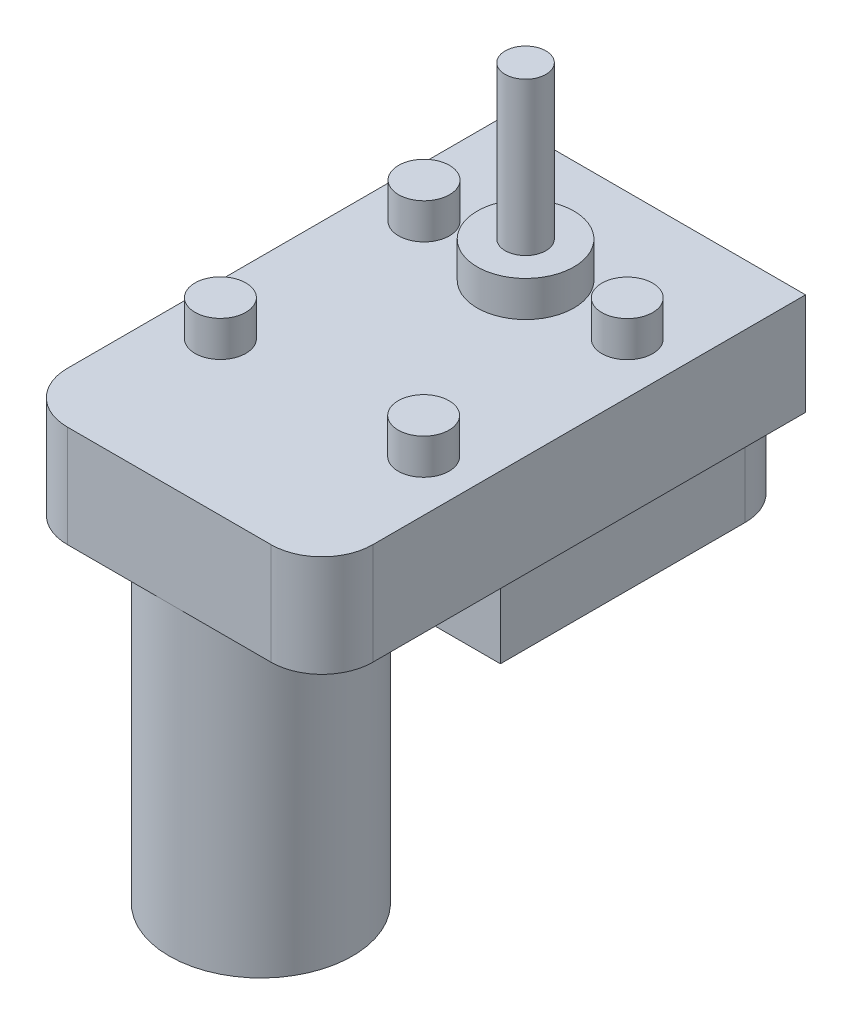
from build123d import *

# Parameters (mm, degrees)
SKETCH1_W           = 60
SKETCH1_H           = 95
BOSS_EXTRUDE1_DEPTH = 20
SKETCH2_R           = 9.5
SKETCH2_R_2         = 5
BOSS_EXTRUDE2_DEPTH = 7
SKETCH3_R           = 4
BOSS_EXTRUDE3_DEPTH = 30
SKETCH4_R           = 18
BOSS_EXTRUDE4_DEPTH = 60
SKETCH5_W           = 56.874874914
SKETCH5_H           = 58.053628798
BOSS_EXTRUDE5_DEPTH = 14
FILLET3_R           = 10
FILLET4_R           = 10


with BuildPart() as part:
    # Sketch1 → Boss-Extrude1 (new body)
    with BuildSketch(Plane(origin=(0, 0, 0), x_dir=(1, 0, 0), z_dir=(0, 1, 0))):
        with Locations((4.166666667, -33.371212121)):
            Rectangle(SKETCH1_W, SKETCH1_H)
    extrude(amount=BOSS_EXTRUDE1_DEPTH)

    # Sketch2 → Boss-Extrude2 (add)
    with BuildSketch(Plane(origin=(0, 20, 0), x_dir=(1, 0, 0), z_dir=(0, 1, 0))):
        with Locations(Location((4.166666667, -10.871212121, 0), (0, 0, 90))):
            Circle(SKETCH2_R)
        with Locations(Location((24.166666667, -10.894168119, 0), (0, 0, 90))):
            Circle(SKETCH2_R_2)
        with Locations(Location((-15.833333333, -10.814450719, 0), (0, 0, 90))):
            Circle(SKETCH2_R_2)
        with Locations(Location((-15.833333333, -50.814450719, 0), (0, 0, 90))):
            Circle(SKETCH2_R_2)
        with Locations(Location((24.166666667, -50.894168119, 0), (0, 0, 90))):
            Circle(SKETCH2_R_2)
    extrude(amount=BOSS_EXTRUDE2_DEPTH)

    # Sketch3 → Boss-Extrude3 (add)
    with BuildSketch(Plane(origin=(0, 27, 0), x_dir=(1, 0, 0), z_dir=(0, 1, 0))):
        with Locations(Location((4.166666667, -10.871212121, 0), (0, 0, 270))):
            Circle(SKETCH3_R)
    extrude(amount=BOSS_EXTRUDE3_DEPTH)

    # Sketch4 → Boss-Extrude4 (add)
    with BuildSketch(Plane.XZ):
        with Locations(Location((4.166666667, 62.871212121, 0), (0, 0, 90))):
            Circle(SKETCH4_R)
    extrude(amount=BOSS_EXTRUDE4_DEPTH)

    # Sketch5 → Boss-Extrude5 (add)
    with BuildSketch(Plane(origin=(0, 0, 0), x_dir=(-1, 0, 0), z_dir=(0, -1, 0))):
        with Locations((-4.532854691, -15.591245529)):
            Rectangle(SKETCH5_W, SKETCH5_H)
    extrude(amount=BOSS_EXTRUDE5_DEPTH)

    # Fillet3
    fillet3_edges = [part.edges().sort_by_distance(p)[0] for p in [
        (-23.904582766, -7, -13.43556887),
        (32.970292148, -7, -13.43556887),
    ]]
    fillet(fillet3_edges, radius=FILLET3_R)

    # Fillet4
    fillet4_edges = [part.edges().sort_by_distance(p)[0] for p in [
        (34.166666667, 10, 80.871212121),
        (-25.833333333, 10, 80.871212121),
    ]]
    fillet(fillet4_edges, radius=FILLET4_R)


solid = part.part
